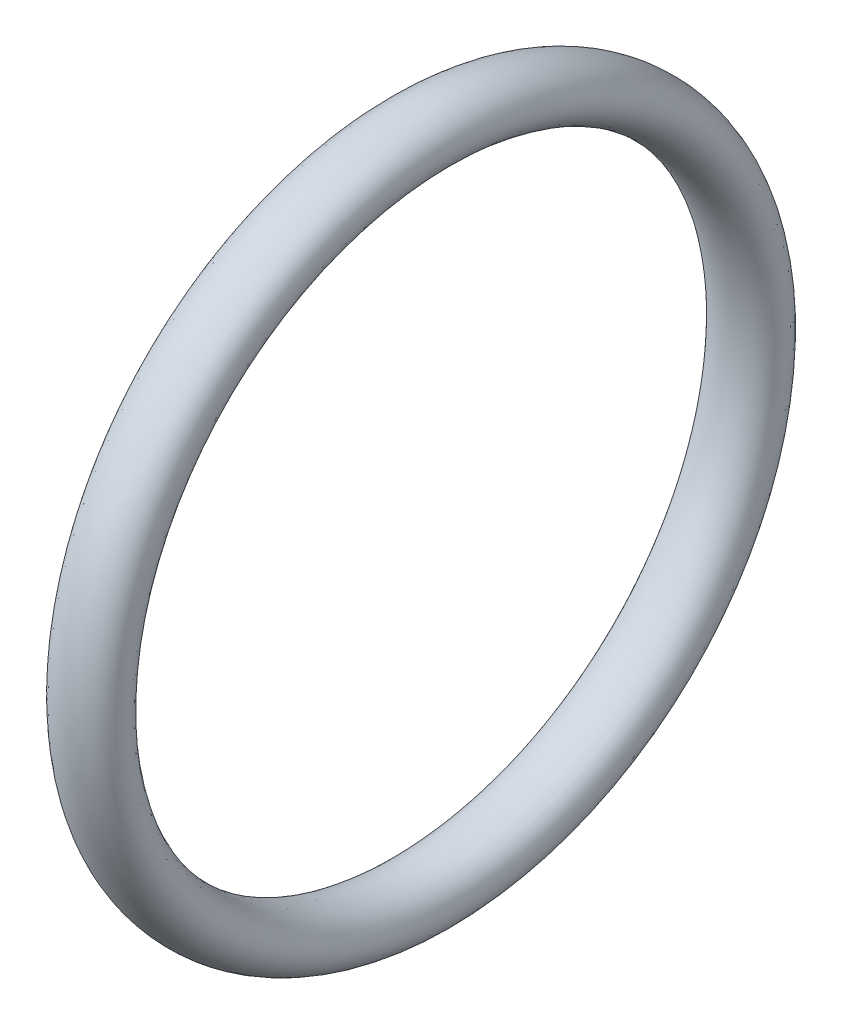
ISO-10303-21;
HEADER;
FILE_DESCRIPTION(('STEP AP214'),'2;1');
FILE_NAME('part.step','',(''),(''),'','','');
FILE_SCHEMA(('AUTOMOTIVE_DESIGN { 1 0 10303 214 1 1 1 1 }'));
ENDSEC;
DATA;
#1=APPLICATION_CONTEXT('core data for automotive mechanical design processes');
#2=APPLICATION_PROTOCOL_DEFINITION('international standard','automotive_design',2000,#1);
#3=PRODUCT_CONTEXT('',#1,'mechanical');
#4=PRODUCT('Part','Part','',(#3));
#5=PRODUCT_RELATED_PRODUCT_CATEGORY('part','',(#4));
#6=PRODUCT_DEFINITION_FORMATION('','',#4);
#7=PRODUCT_DEFINITION_CONTEXT('part definition',#1,'design');
#8=PRODUCT_DEFINITION('design','',#6,#7);
#9=PRODUCT_DEFINITION_SHAPE('','',#8);
#10=(LENGTH_UNIT() NAMED_UNIT(*) SI_UNIT(.MILLI.,.METRE.));
#11=(NAMED_UNIT(*) PLANE_ANGLE_UNIT() SI_UNIT($,.RADIAN.));
#12=(NAMED_UNIT(*) SI_UNIT($,.STERADIAN.) SOLID_ANGLE_UNIT());
#13=UNCERTAINTY_MEASURE_WITH_UNIT(LENGTH_MEASURE(1.E-05),#10,'distance_accuracy_value','');
#14=(GEOMETRIC_REPRESENTATION_CONTEXT(3) GLOBAL_UNCERTAINTY_ASSIGNED_CONTEXT((#13)) GLOBAL_UNIT_ASSIGNED_CONTEXT((#10,
#11,#12)) REPRESENTATION_CONTEXT('',''));
#15=CARTESIAN_POINT('',(0.,0.,0.));
#16=DIRECTION('',(0.,0.,1.));
#17=DIRECTION('',(1.,0.,0.));
#18=AXIS2_PLACEMENT_3D('',#15,#16,#17);
#19=CARTESIAN_POINT('',(0.,18.5,0.));
#20=DIRECTION('',(0.,0.,1.));
#21=DIRECTION('',(1.,0.,0.));
#22=AXIS2_PLACEMENT_3D('',#19,#20,#21);
#23=ELLIPSE('',#22,2.,1.5);
#24=CARTESIAN_POINT('',(0.,0.,0.));
#25=DIRECTION('',(-1.,0.,0.));
#26=AXIS1_PLACEMENT('',#24,#25);
#27=SURFACE_OF_REVOLUTION('',#23,#26);
#28=ADVANCED_FACE('F27',(),#27,.T.);
#29=CLOSED_SHELL('',(#28));
#30=MANIFOLD_SOLID_BREP('B2',#29);
#31=ADVANCED_BREP_SHAPE_REPRESENTATION('',(#18,#30),#14);
#32=SHAPE_DEFINITION_REPRESENTATION(#9,#31);
ENDSEC;
END-ISO-10303-21;
